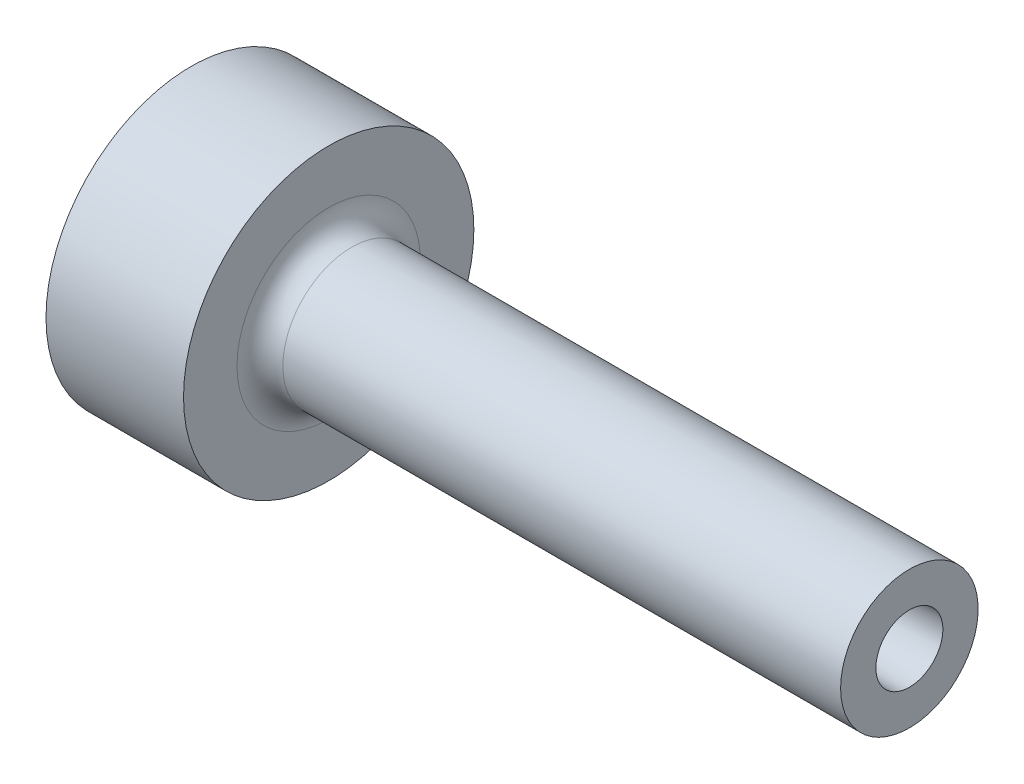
ISO-10303-21;
HEADER;
FILE_DESCRIPTION(('STEP AP214'),'2;1');
FILE_NAME('part.step','',(''),(''),'','','');
FILE_SCHEMA(('AUTOMOTIVE_DESIGN { 1 0 10303 214 1 1 1 1 }'));
ENDSEC;
DATA;
#1=APPLICATION_CONTEXT('core data for automotive mechanical design processes');
#2=APPLICATION_PROTOCOL_DEFINITION('international standard','automotive_design',2000,#1);
#3=PRODUCT_CONTEXT('',#1,'mechanical');
#4=PRODUCT('Part','Part','',(#3));
#5=PRODUCT_RELATED_PRODUCT_CATEGORY('part','',(#4));
#6=PRODUCT_DEFINITION_FORMATION('','',#4);
#7=PRODUCT_DEFINITION_CONTEXT('part definition',#1,'design');
#8=PRODUCT_DEFINITION('design','',#6,#7);
#9=PRODUCT_DEFINITION_SHAPE('','',#8);
#10=(LENGTH_UNIT() NAMED_UNIT(*) SI_UNIT(.MILLI.,.METRE.));
#11=(NAMED_UNIT(*) PLANE_ANGLE_UNIT() SI_UNIT($,.RADIAN.));
#12=(NAMED_UNIT(*) SI_UNIT($,.STERADIAN.) SOLID_ANGLE_UNIT());
#13=UNCERTAINTY_MEASURE_WITH_UNIT(LENGTH_MEASURE(1.E-05),#10,'distance_accuracy_value','');
#14=(GEOMETRIC_REPRESENTATION_CONTEXT(3) GLOBAL_UNCERTAINTY_ASSIGNED_CONTEXT((#13)) GLOBAL_UNIT_ASSIGNED_CONTEXT((#10,
#11,#12)) REPRESENTATION_CONTEXT('',''));
#15=CARTESIAN_POINT('',(0.,0.,0.));
#16=DIRECTION('',(0.,0.,1.));
#17=DIRECTION('',(1.,0.,0.));
#18=AXIS2_PLACEMENT_3D('',#15,#16,#17);
#19=CARTESIAN_POINT('',(0.,0.,0.));
#20=DIRECTION('',(-1.,0.,0.));
#21=DIRECTION('',(0.,0.,1.));
#22=AXIS2_PLACEMENT_3D('',#19,#20,#21);
#23=CYLINDRICAL_SURFACE('',#22,19.);
#24=CARTESIAN_POINT('',(18.,0.,0.));
#25=DIRECTION('',(-1.,0.,0.));
#26=DIRECTION('',(0.,0.,1.));
#27=AXIS2_PLACEMENT_3D('',#24,#25,#26);
#28=CIRCLE('',#27,19.);
#29=CARTESIAN_POINT('',(18.,0.,19.));
#30=VERTEX_POINT('',#29);
#31=EDGE_CURVE('E90',#30,#30,#28,.T.);
#32=ORIENTED_EDGE('',*,*,#31,.T.);
#33=EDGE_LOOP('',(#32));
#34=FACE_BOUND('',#33,.T.);
#35=CARTESIAN_POINT('',(0.,0.,0.));
#36=DIRECTION('',(-1.,0.,0.));
#37=DIRECTION('',(0.,0.,1.));
#38=AXIS2_PLACEMENT_3D('',#35,#36,#37);
#39=CIRCLE('',#38,19.);
#40=CARTESIAN_POINT('',(0.,0.,19.));
#41=VERTEX_POINT('',#40);
#42=EDGE_CURVE('E84',#41,#41,#39,.T.);
#43=ORIENTED_EDGE('',*,*,#42,.F.);
#44=EDGE_LOOP('',(#43));
#45=FACE_BOUND('',#44,.T.);
#46=CARTESIAN_POINT('',(11.,-19.,0.));
#47=CARTESIAN_POINT('',(10.9999951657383,-18.9999986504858,0.11200841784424));
#48=CARTESIAN_POINT('',(10.9905588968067,-18.9989990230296,0.224090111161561));
#49=CARTESIAN_POINT('',(10.953059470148,-18.9951074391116,0.445143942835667));
#50=CARTESIAN_POINT('',(10.9249759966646,-18.9922134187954,0.554112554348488));
#51=CARTESIAN_POINT('',(10.8510107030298,-18.9848596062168,0.765707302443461));
#52=CARTESIAN_POINT('',(10.8051398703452,-18.9804007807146,0.868337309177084));
#53=CARTESIAN_POINT('',(10.696923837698,-18.9704154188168,1.06441973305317));
#54=CARTESIAN_POINT('',(10.6345818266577,-18.9648890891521,1.15787392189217));
#55=CARTESIAN_POINT('',(10.494927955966,-18.9533628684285,1.33334438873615));
#56=CARTESIAN_POINT('',(10.417564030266,-18.9473613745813,1.41531912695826));
#57=CARTESIAN_POINT('',(10.2501736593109,-18.9355744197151,1.565146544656));
#58=CARTESIAN_POINT('',(10.1601466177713,-18.9297889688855,1.63299855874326));
#59=CARTESIAN_POINT('',(9.96972339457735,-18.9190729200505,1.75280323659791));
#60=CARTESIAN_POINT('',(9.86930325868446,-18.914144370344,1.80471802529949));
#61=CARTESIAN_POINT('',(9.66111022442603,-18.9057203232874,1.89093273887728));
#62=CARTESIAN_POINT('',(9.55333752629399,-18.90222478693,1.92523314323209));
#63=CARTESIAN_POINT('',(9.333924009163,-18.8970772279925,1.97512160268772));
#64=CARTESIAN_POINT('',(9.22229908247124,-18.89541839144,1.99077883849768));
#65=CARTESIAN_POINT('',(8.99799439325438,-18.8941109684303,2.0031504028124));
#66=CARTESIAN_POINT('',(8.88531466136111,-18.8944623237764,1.99986527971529));
#67=CARTESIAN_POINT('',(8.66257681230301,-18.8971293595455,1.97450235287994));
#68=CARTESIAN_POINT('',(8.55250997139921,-18.8994371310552,1.9525002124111));
#69=CARTESIAN_POINT('',(8.33763983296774,-18.9057446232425,1.89044560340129));
#70=CARTESIAN_POINT('',(8.23283661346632,-18.9097443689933,1.85039286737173));
#71=CARTESIAN_POINT('',(8.0312304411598,-18.9189942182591,1.75329092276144));
#72=CARTESIAN_POINT('',(7.93444370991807,-18.924246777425,1.69620827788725));
#73=CARTESIAN_POINT('',(7.75179548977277,-18.9354083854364,1.5666908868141));
#74=CARTESIAN_POINT('',(7.66593435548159,-18.9413174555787,1.49425564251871));
#75=CARTESIAN_POINT('',(7.50713503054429,-18.9531615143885,1.33566725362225));
#76=CARTESIAN_POINT('',(7.43426205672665,-18.9590964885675,1.24944878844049));
#77=CARTESIAN_POINT('',(7.30401357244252,-18.9702964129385,1.06596783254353));
#78=CARTESIAN_POINT('',(7.24663808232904,-18.9755613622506,0.968705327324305));
#79=CARTESIAN_POINT('',(7.14901535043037,-18.9848300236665,0.765851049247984));
#80=CARTESIAN_POINT('',(7.10877156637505,-18.9888334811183,0.660257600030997));
#81=CARTESIAN_POINT('',(7.04660317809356,-18.9951255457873,0.443760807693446));
#82=CARTESIAN_POINT('',(7.02467796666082,-18.9974142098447,0.332857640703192));
#83=CARTESIAN_POINT('',(6.9998521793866,-19.0000115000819,0.109454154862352));
#84=CARTESIAN_POINT('',(6.9968616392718,-19.0003294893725,-0.00303606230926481));
#85=CARTESIAN_POINT('',(7.00975357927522,-18.9989747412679,-0.226916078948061));
#86=CARTESIAN_POINT('',(7.02563577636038,-18.9973020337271,-0.338305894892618));
#87=CARTESIAN_POINT('',(7.07574769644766,-18.9921598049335,-0.556562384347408));
#88=CARTESIAN_POINT('',(7.10993514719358,-18.9886944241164,-0.663438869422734));
#89=CARTESIAN_POINT('',(7.1956435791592,-18.9803554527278,-0.869940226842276));
#90=CARTESIAN_POINT('',(7.24716498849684,-18.9754818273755,-0.969564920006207));
#91=CARTESIAN_POINT('',(7.36630089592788,-18.9648478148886,-1.1591405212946));
#92=CARTESIAN_POINT('',(7.43397432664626,-18.9590842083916,-1.2490542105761));
#93=CARTESIAN_POINT('',(7.58340899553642,-18.9473268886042,-1.4162783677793));
#94=CARTESIAN_POINT('',(7.665170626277,-18.9413331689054,-1.49358848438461));
#95=CARTESIAN_POINT('',(7.84085406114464,-18.9297628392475,-1.63372463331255));
#96=CARTESIAN_POINT('',(7.93482318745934,-18.9241879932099,-1.69649150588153));
#97=CARTESIAN_POINT('',(8.13202150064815,-18.9141138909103,-1.80535237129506));
#98=CARTESIAN_POINT('',(8.23525054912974,-18.9096146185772,-1.85144661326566));
#99=CARTESIAN_POINT('',(8.44783784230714,-18.9022123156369,-1.9255553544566));
#100=CARTESIAN_POINT('',(8.55718382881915,-18.8993062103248,-1.95360469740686));
#101=CARTESIAN_POINT('',(8.77906579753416,-18.8954098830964,-1.99094032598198));
#102=CARTESIAN_POINT('',(8.89160167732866,-18.8944195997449,-2.00022721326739));
#103=CARTESIAN_POINT('',(9.11608086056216,-18.8944684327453,-1.99976544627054));
#104=CARTESIAN_POINT('',(9.22802436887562,-18.8954976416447,-1.99010972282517));
#105=CARTESIAN_POINT('',(9.4486892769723,-18.8994483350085,-1.95223204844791));
#106=CARTESIAN_POINT('',(9.55741067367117,-18.9023698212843,-1.92401007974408));
#107=CARTESIAN_POINT('',(9.76854219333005,-18.9097730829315,-1.8498273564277));
#108=CARTESIAN_POINT('',(9.87095340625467,-18.914254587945,-1.80386967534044));
#109=CARTESIAN_POINT('',(10.0666237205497,-18.92427346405,-1.69552954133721));
#110=CARTESIAN_POINT('',(10.1598828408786,-18.9298108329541,-1.63314712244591));
#111=CARTESIAN_POINT('',(10.3350778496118,-18.9413500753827,-1.49337993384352));
#112=CARTESIAN_POINT('',(10.4169583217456,-18.9473540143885,-1.41592586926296));
#113=CARTESIAN_POINT('',(10.5665993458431,-18.9591311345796,-1.24835332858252));
#114=CARTESIAN_POINT('',(10.6343565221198,-18.9649042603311,-1.15823183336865));
#115=CARTESIAN_POINT('',(10.7539774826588,-18.975586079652,-0.967607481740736));
#116=CARTESIAN_POINT('',(10.8057969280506,-18.9804923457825,-0.867076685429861));
#117=CARTESIAN_POINT('',(10.8917493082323,-18.9888617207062,-0.658751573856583));
#118=CARTESIAN_POINT('',(10.9259020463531,-18.9923264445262,-0.550965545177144));
#119=CARTESIAN_POINT('',(10.9671005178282,-18.9965585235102,-0.368815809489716));
#120=CARTESIAN_POINT('',(10.9794208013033,-18.9978430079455,-0.295613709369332));
#121=CARTESIAN_POINT('',(10.9958721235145,-18.9995641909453,-0.148285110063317));
#122=CARTESIAN_POINT('',(11.0000032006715,-19.0000008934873,-0.0741586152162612));
#123=CARTESIAN_POINT('',(11.,-19.,0.));
#124=B_SPLINE_CURVE_WITH_KNOTS('',3,(#46,#47,#48,#49,#50,#51,#52,#53,#54,#55,#56,#57,#58,#59,
#60,#61,#62,#63,#64,#65,#66,#67,#68,#69,#70,#71,#72,#73,#74,#75,#76,#77,#78,#79,#80,#81,#82,#83,
#84,#85,#86,#87,#88,#89,#90,#91,#92,#93,#94,#95,#96,#97,#98,#99,#100,#101,#102,#103,#104,#105,
#106,#107,#108,#109,#110,#111,#112,#113,#114,#115,#116,#117,#118,#119,#120,#121,#122,#123),
.UNSPECIFIED.,.T.,.F.,(4,2,2,2,2,2,2,2,2,2,2,2,2,2,2,2,2,2,2,2,2,2,2,2,2,2,2,2,2,2,2,2,2,2,2,2,
2,2,4),(0.,0.335754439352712,0.671875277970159,1.00778882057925,1.34363737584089,
1.68067146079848,2.01772142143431,2.35556629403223,2.69340196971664,3.02998006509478,
3.36654841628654,3.7017626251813,4.03698180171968,4.37286352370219,4.70875614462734,
5.0462905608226,5.38382542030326,5.72142837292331,6.05902013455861,6.39500668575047,
6.73098819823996,7.06619715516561,7.40141439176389,7.73787392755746,8.07434284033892,
8.41215732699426,8.74996676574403,9.08712193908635,9.42426630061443,9.75976079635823,
10.095255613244,10.4306923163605,10.7661283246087,11.103144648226,11.4402414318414,
11.7782677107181,12.1159142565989,12.3382118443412,12.5605083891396),.UNSPECIFIED.);
#125=CARTESIAN_POINT('',(11.,-19.,0.));
#126=VERTEX_POINT('',#125);
#127=EDGE_CURVE('E10',#126,#126,#124,.T.);
#128=ORIENTED_EDGE('',*,*,#127,.F.);
#129=EDGE_LOOP('',(#128));
#130=FACE_BOUND('',#129,.T.);
#131=ADVANCED_FACE('F16',(#34,#45,#130),#23,.T.);
#132=CARTESIAN_POINT('',(0.,0.,0.));
#133=DIRECTION('',(1.,0.,0.));
#134=DIRECTION('',(0.,0.,-1.));
#135=AXIS2_PLACEMENT_3D('',#132,#133,#134);
#136=CONICAL_SURFACE('',#135,2.25,0.0226892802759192);
#137=CARTESIAN_POINT('',(94.,0.,0.));
#138=DIRECTION('',(-1.,0.,0.));
#139=DIRECTION('',(0.,0.,1.));
#140=AXIS2_PLACEMENT_3D('',#137,#138,#139);
#141=CIRCLE('',#140,4.38315841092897);
#142=CARTESIAN_POINT('',(94.,0.,4.38315841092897));
#143=VERTEX_POINT('',#142);
#144=EDGE_CURVE('E77',#143,#143,#141,.T.);
#145=ORIENTED_EDGE('',*,*,#144,.F.);
#146=EDGE_LOOP('',(#145));
#147=FACE_BOUND('',#146,.T.);
#148=CARTESIAN_POINT('',(3.81173528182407,0.,0.));
#149=DIRECTION('',(-1.,0.,0.));
#150=DIRECTION('',(0.,0.,1.));
#151=AXIS2_PLACEMENT_3D('',#148,#149,#150);
#152=CIRCLE('',#151,2.33650037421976);
#153=CARTESIAN_POINT('',(3.81173528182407,0.,2.33650037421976));
#154=VERTEX_POINT('',#153);
#155=EDGE_CURVE('E97',#154,#154,#152,.F.);
#156=ORIENTED_EDGE('',*,*,#155,.F.);
#157=EDGE_LOOP('',(#156));
#158=FACE_BOUND('',#157,.T.);
#159=ADVANCED_FACE('F44',(#147,#158),#136,.F.);
#160=CARTESIAN_POINT('',(21.,0.,0.));
#161=DIRECTION('',(-1.,0.,0.));
#162=DIRECTION('',(0.,0.,1.));
#163=AXIS2_PLACEMENT_3D('',#160,#161,#162);
#164=TOROIDAL_SURFACE('',#163,12.,3.);
#165=CARTESIAN_POINT('',(18.,0.,0.));
#166=DIRECTION('',(-1.,0.,0.));
#167=DIRECTION('',(0.,0.,1.));
#168=AXIS2_PLACEMENT_3D('',#165,#166,#167);
#169=CIRCLE('',#168,12.);
#170=CARTESIAN_POINT('',(18.,0.,12.));
#171=VERTEX_POINT('',#170);
#172=EDGE_CURVE('E93',#171,#171,#169,.T.);
#173=ORIENTED_EDGE('',*,*,#172,.F.);
#174=EDGE_LOOP('',(#173));
#175=FACE_BOUND('',#174,.T.);
#176=CARTESIAN_POINT('',(21.,0.,0.));
#177=DIRECTION('',(-1.,0.,0.));
#178=DIRECTION('',(0.,0.,1.));
#179=AXIS2_PLACEMENT_3D('',#176,#177,#178);
#180=CIRCLE('',#179,9.);
#181=CARTESIAN_POINT('',(21.,0.,9.));
#182=VERTEX_POINT('',#181);
#183=EDGE_CURVE('E29',#182,#182,#180,.T.);
#184=ORIENTED_EDGE('',*,*,#183,.T.);
#185=EDGE_LOOP('',(#184));
#186=FACE_BOUND('',#185,.T.);
#187=ADVANCED_FACE('F18',(#175,#186),#164,.F.);
#188=CARTESIAN_POINT('',(0.,0.,0.));
#189=DIRECTION('',(-1.,0.,0.));
#190=DIRECTION('',(0.,0.,1.));
#191=AXIS2_PLACEMENT_3D('',#188,#189,#190);
#192=CYLINDRICAL_SURFACE('',#191,9.);
#193=ORIENTED_EDGE('',*,*,#183,.F.);
#194=EDGE_LOOP('',(#193));
#195=FACE_BOUND('',#194,.T.);
#196=CARTESIAN_POINT('',(94.,0.,0.));
#197=DIRECTION('',(-1.,0.,0.));
#198=DIRECTION('',(0.,0.,1.));
#199=AXIS2_PLACEMENT_3D('',#196,#197,#198);
#200=CIRCLE('',#199,9.);
#201=CARTESIAN_POINT('',(94.,0.,9.));
#202=VERTEX_POINT('',#201);
#203=EDGE_CURVE('E75',#202,#202,#200,.T.);
#204=ORIENTED_EDGE('',*,*,#203,.T.);
#205=EDGE_LOOP('',(#204));
#206=FACE_BOUND('',#205,.T.);
#207=ADVANCED_FACE('F63',(#195,#206),#192,.T.);
#208=CARTESIAN_POINT('',(94.,9.,0.));
#209=DIRECTION('',(-1.,0.,0.));
#210=DIRECTION('',(0.,0.,1.));
#211=AXIS2_PLACEMENT_3D('',#208,#209,#210);
#212=PLANE('',#211);
#213=ORIENTED_EDGE('',*,*,#203,.F.);
#214=EDGE_LOOP('',(#213));
#215=FACE_BOUND('',#214,.T.);
#216=ORIENTED_EDGE('',*,*,#144,.T.);
#217=EDGE_LOOP('',(#216));
#218=FACE_BOUND('',#217,.T.);
#219=ADVANCED_FACE('F59',(#215,#218),#212,.F.);
#220=CARTESIAN_POINT('',(0.,2.25,0.));
#221=DIRECTION('',(1.,0.,0.));
#222=DIRECTION('',(0.,0.,-1.));
#223=AXIS2_PLACEMENT_3D('',#220,#221,#222);
#224=PLANE('',#223);
#225=CARTESIAN_POINT('',(0.,0.,0.));
#226=DIRECTION('',(-1.,0.,0.));
#227=DIRECTION('',(0.,0.,1.));
#228=AXIS2_PLACEMENT_3D('',#225,#226,#227);
#229=CIRCLE('',#228,15.5);
#230=CARTESIAN_POINT('',(0.,0.,15.5));
#231=VERTEX_POINT('',#230);
#232=EDGE_CURVE('E101',#231,#231,#229,.T.);
#233=ORIENTED_EDGE('',*,*,#232,.F.);
#234=EDGE_LOOP('',(#233));
#235=FACE_BOUND('',#234,.T.);
#236=ORIENTED_EDGE('',*,*,#42,.T.);
#237=EDGE_LOOP('',(#236));
#238=FACE_BOUND('',#237,.T.);
#239=ADVANCED_FACE('F57',(#235,#238),#224,.F.);
#240=CARTESIAN_POINT('',(18.,19.,0.));
#241=DIRECTION('',(-1.,0.,0.));
#242=DIRECTION('',(0.,0.,1.));
#243=AXIS2_PLACEMENT_3D('',#240,#241,#242);
#244=PLANE('',#243);
#245=ORIENTED_EDGE('',*,*,#31,.F.);
#246=EDGE_LOOP('',(#245));
#247=FACE_BOUND('',#246,.T.);
#248=ORIENTED_EDGE('',*,*,#172,.T.);
#249=EDGE_LOOP('',(#248));
#250=FACE_BOUND('',#249,.T.);
#251=ADVANCED_FACE('F55',(#247,#250),#244,.F.);
#252=CARTESIAN_POINT('',(-35.9477938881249,0.,0.));
#253=DIRECTION('',(-1.,0.,0.));
#254=DIRECTION('',(0.,0.,1.));
#255=AXIS2_PLACEMENT_3D('',#252,#253,#254);
#256=DEGENERATE_TOROIDAL_SURFACE('',#255,2.0429790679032,40.,.F.);
#257=ORIENTED_EDGE('',*,*,#232,.T.);
#258=EDGE_LOOP('',(#257));
#259=FACE_BOUND('',#258,.T.);
#260=ORIENTED_EDGE('',*,*,#155,.T.);
#261=EDGE_LOOP('',(#260));
#262=FACE_BOUND('',#261,.T.);
#263=ADVANCED_FACE('F40',(#259,#262),#256,.T.);
#264=CARTESIAN_POINT('',(9.,-19.,0.));
#265=DIRECTION('',(0.,-1.,0.));
#266=DIRECTION('',(1.,0.,0.));
#267=AXIS2_PLACEMENT_3D('',#264,#265,#266);
#268=CYLINDRICAL_SURFACE('',#267,2.);
#269=CARTESIAN_POINT('',(9.,-13.,0.));
#270=DIRECTION('',(0.,-1.,0.));
#271=DIRECTION('',(1.,0.,0.));
#272=AXIS2_PLACEMENT_3D('',#269,#270,#271);
#273=CIRCLE('',#272,2.);
#274=CARTESIAN_POINT('',(11.,-13.,0.));
#275=VERTEX_POINT('',#274);
#276=EDGE_CURVE('E104',#275,#275,#273,.T.);
#277=ORIENTED_EDGE('',*,*,#276,.F.);
#278=EDGE_LOOP('',(#277));
#279=FACE_BOUND('',#278,.T.);
#280=ORIENTED_EDGE('',*,*,#127,.T.);
#281=EDGE_LOOP('',(#280));
#282=FACE_BOUND('',#281,.T.);
#283=ADVANCED_FACE('F34',(#279,#282),#268,.F.);
#284=CARTESIAN_POINT('',(9.,-11.8452994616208,0.));
#285=DIRECTION('',(0.,-1.,0.));
#286=DIRECTION('',(1.,0.,0.));
#287=AXIS2_PLACEMENT_3D('',#284,#285,#286);
#288=CONICAL_SURFACE('',#287,0.,1.0471975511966);
#289=ORIENTED_EDGE('',*,*,#276,.T.);
#290=EDGE_LOOP('',(#289));
#291=FACE_BOUND('',#290,.T.);
#292=CARTESIAN_POINT('',(9.,-11.8452994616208,0.));
#293=VERTEX_POINT('',#292);
#294=VERTEX_LOOP('',#293);
#295=FACE_BOUND('',#294,.T.);
#296=ADVANCED_FACE('F32',(#291,#295),#288,.F.);
#297=CLOSED_SHELL('',(#131,#159,#187,#207,#219,#239,#251,#263,#283,#296));
#298=MANIFOLD_SOLID_BREP('B1',#297);
#299=ADVANCED_BREP_SHAPE_REPRESENTATION('',(#18,#298),#14);
#300=SHAPE_DEFINITION_REPRESENTATION(#9,#299);
ENDSEC;
END-ISO-10303-21;
